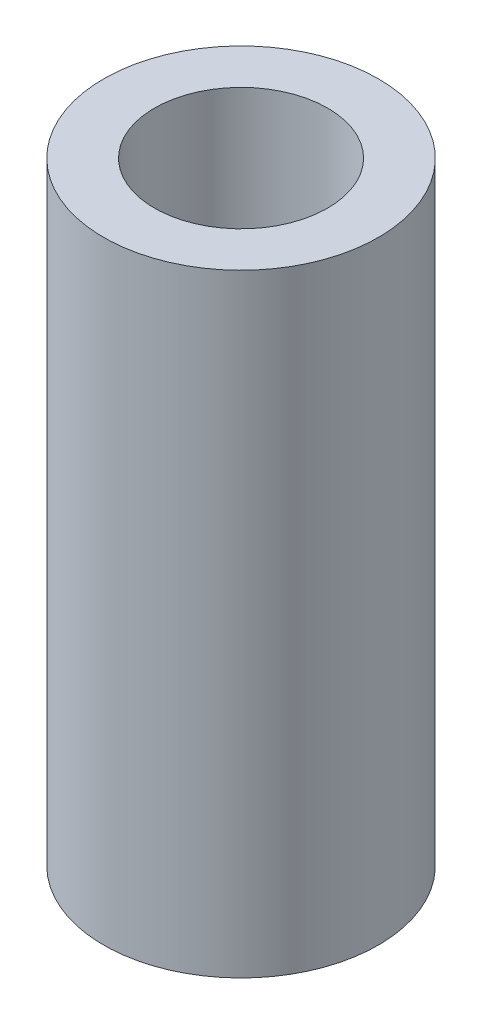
ISO-10303-21;
HEADER;
FILE_DESCRIPTION(('STEP AP214'),'2;1');
FILE_NAME('part.step','',(''),(''),'','','');
FILE_SCHEMA(('AUTOMOTIVE_DESIGN { 1 0 10303 214 1 1 1 1 }'));
ENDSEC;
DATA;
#1=APPLICATION_CONTEXT('core data for automotive mechanical design processes');
#2=APPLICATION_PROTOCOL_DEFINITION('international standard','automotive_design',2000,#1);
#3=PRODUCT_CONTEXT('',#1,'mechanical');
#4=PRODUCT('Part','Part','',(#3));
#5=PRODUCT_RELATED_PRODUCT_CATEGORY('part','',(#4));
#6=PRODUCT_DEFINITION_FORMATION('','',#4);
#7=PRODUCT_DEFINITION_CONTEXT('part definition',#1,'design');
#8=PRODUCT_DEFINITION('design','',#6,#7);
#9=PRODUCT_DEFINITION_SHAPE('','',#8);
#10=(LENGTH_UNIT() NAMED_UNIT(*) SI_UNIT(.MILLI.,.METRE.));
#11=(NAMED_UNIT(*) PLANE_ANGLE_UNIT() SI_UNIT($,.RADIAN.));
#12=(NAMED_UNIT(*) SI_UNIT($,.STERADIAN.) SOLID_ANGLE_UNIT());
#13=UNCERTAINTY_MEASURE_WITH_UNIT(LENGTH_MEASURE(1.E-05),#10,'distance_accuracy_value','');
#14=(GEOMETRIC_REPRESENTATION_CONTEXT(3) GLOBAL_UNCERTAINTY_ASSIGNED_CONTEXT((#13)) GLOBAL_UNIT_ASSIGNED_CONTEXT((#10,
#11,#12)) REPRESENTATION_CONTEXT('',''));
#15=CARTESIAN_POINT('',(0.,0.,0.));
#16=DIRECTION('',(0.,0.,1.));
#17=DIRECTION('',(1.,0.,0.));
#18=AXIS2_PLACEMENT_3D('',#15,#16,#17);
#19=CARTESIAN_POINT('',(0.,29.,0.));
#20=DIRECTION('',(0.,1.,0.));
#21=DIRECTION('',(0.,0.,1.));
#22=AXIS2_PLACEMENT_3D('',#19,#20,#21);
#23=PLANE('',#22);
#24=CARTESIAN_POINT('',(0.,29.,0.));
#25=DIRECTION('',(0.,1.,0.));
#26=DIRECTION('',(0.,0.,1.));
#27=AXIS2_PLACEMENT_3D('',#24,#25,#26);
#28=CIRCLE('',#27,6.5);
#29=CARTESIAN_POINT('',(0.,29.,-6.5));
#30=VERTEX_POINT('',#29);
#31=EDGE_CURVE('E10',#30,#30,#28,.T.);
#32=ORIENTED_EDGE('',*,*,#31,.T.);
#33=EDGE_LOOP('',(#32));
#34=FACE_BOUND('',#33,.T.);
#35=CARTESIAN_POINT('',(0.,29.,0.));
#36=DIRECTION('',(0.,1.,0.));
#37=DIRECTION('',(0.,0.,1.));
#38=AXIS2_PLACEMENT_3D('',#35,#36,#37);
#39=CIRCLE('',#38,4.1);
#40=CARTESIAN_POINT('',(0.,29.,-4.1));
#41=VERTEX_POINT('',#40);
#42=EDGE_CURVE('E43',#41,#41,#39,.T.);
#43=ORIENTED_EDGE('',*,*,#42,.F.);
#44=EDGE_LOOP('',(#43));
#45=FACE_BOUND('',#44,.T.);
#46=ADVANCED_FACE('F32',(#34,#45),#23,.T.);
#47=CARTESIAN_POINT('',(0.,0.,0.));
#48=DIRECTION('',(0.,1.,0.));
#49=DIRECTION('',(0.,0.,1.));
#50=AXIS2_PLACEMENT_3D('',#47,#48,#49);
#51=PLANE('',#50);
#52=CARTESIAN_POINT('',(0.,0.,0.));
#53=DIRECTION('',(0.,1.,0.));
#54=DIRECTION('',(0.,0.,1.));
#55=AXIS2_PLACEMENT_3D('',#52,#53,#54);
#56=CIRCLE('',#55,6.5);
#57=CARTESIAN_POINT('',(0.,0.,-6.5));
#58=VERTEX_POINT('',#57);
#59=EDGE_CURVE('E39',#58,#58,#56,.T.);
#60=ORIENTED_EDGE('',*,*,#59,.F.);
#61=EDGE_LOOP('',(#60));
#62=FACE_BOUND('',#61,.T.);
#63=CARTESIAN_POINT('',(0.,0.,0.));
#64=DIRECTION('',(0.,1.,0.));
#65=DIRECTION('',(0.,0.,1.));
#66=AXIS2_PLACEMENT_3D('',#63,#64,#65);
#67=CIRCLE('',#66,4.1);
#68=CARTESIAN_POINT('',(0.,0.,-4.1));
#69=VERTEX_POINT('',#68);
#70=EDGE_CURVE('E47',#69,#69,#67,.T.);
#71=ORIENTED_EDGE('',*,*,#70,.T.);
#72=EDGE_LOOP('',(#71));
#73=FACE_BOUND('',#72,.T.);
#74=ADVANCED_FACE('F53',(#62,#73),#51,.F.);
#75=CARTESIAN_POINT('',(0.,29.,0.));
#76=DIRECTION('',(0.,-1.,0.));
#77=DIRECTION('',(0.,0.,-1.));
#78=AXIS2_PLACEMENT_3D('',#75,#76,#77);
#79=CYLINDRICAL_SURFACE('',#78,6.5);
#80=CARTESIAN_POINT('',(0.,29.,-6.5));
#81=CARTESIAN_POINT('',(0.,28.6979166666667,-6.5));
#82=CARTESIAN_POINT('',(0.,28.3958333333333,-6.5));
#83=CARTESIAN_POINT('',(0.,27.7916666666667,-6.5));
#84=CARTESIAN_POINT('',(0.,27.4895833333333,-6.5));
#85=CARTESIAN_POINT('',(0.,26.8854166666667,-6.5));
#86=CARTESIAN_POINT('',(0.,26.5833333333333,-6.5));
#87=CARTESIAN_POINT('',(0.,25.9791666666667,-6.5));
#88=CARTESIAN_POINT('',(0.,25.6770833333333,-6.5));
#89=CARTESIAN_POINT('',(0.,25.0729166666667,-6.5));
#90=CARTESIAN_POINT('',(0.,24.7708333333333,-6.5));
#91=CARTESIAN_POINT('',(0.,24.1666666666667,-6.5));
#92=CARTESIAN_POINT('',(0.,23.8645833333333,-6.5));
#93=CARTESIAN_POINT('',(0.,23.2604166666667,-6.5));
#94=CARTESIAN_POINT('',(0.,22.9583333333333,-6.5));
#95=CARTESIAN_POINT('',(0.,22.3541666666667,-6.5));
#96=CARTESIAN_POINT('',(0.,22.0520833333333,-6.5));
#97=CARTESIAN_POINT('',(0.,21.4479166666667,-6.5));
#98=CARTESIAN_POINT('',(0.,21.1458333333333,-6.5));
#99=CARTESIAN_POINT('',(0.,20.5416666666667,-6.5));
#100=CARTESIAN_POINT('',(0.,20.2395833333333,-6.5));
#101=CARTESIAN_POINT('',(0.,19.6354166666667,-6.5));
#102=CARTESIAN_POINT('',(0.,19.3333333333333,-6.5));
#103=CARTESIAN_POINT('',(0.,18.7291666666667,-6.5));
#104=CARTESIAN_POINT('',(0.,18.4270833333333,-6.5));
#105=CARTESIAN_POINT('',(0.,17.8229166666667,-6.5));
#106=CARTESIAN_POINT('',(0.,17.5208333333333,-6.5));
#107=CARTESIAN_POINT('',(0.,16.9166666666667,-6.5));
#108=CARTESIAN_POINT('',(0.,16.6145833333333,-6.5));
#109=CARTESIAN_POINT('',(0.,16.0104166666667,-6.5));
#110=CARTESIAN_POINT('',(0.,15.7083333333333,-6.5));
#111=CARTESIAN_POINT('',(0.,15.1041666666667,-6.5));
#112=CARTESIAN_POINT('',(0.,14.8020833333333,-6.5));
#113=CARTESIAN_POINT('',(0.,14.1979166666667,-6.5));
#114=CARTESIAN_POINT('',(0.,13.8958333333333,-6.5));
#115=CARTESIAN_POINT('',(0.,13.2916666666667,-6.5));
#116=CARTESIAN_POINT('',(0.,12.9895833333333,-6.5));
#117=CARTESIAN_POINT('',(0.,12.3854166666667,-6.5));
#118=CARTESIAN_POINT('',(0.,12.0833333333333,-6.5));
#119=CARTESIAN_POINT('',(0.,11.4791666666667,-6.5));
#120=CARTESIAN_POINT('',(0.,11.1770833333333,-6.5));
#121=CARTESIAN_POINT('',(0.,10.5729166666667,-6.5));
#122=CARTESIAN_POINT('',(0.,10.2708333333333,-6.5));
#123=CARTESIAN_POINT('',(0.,9.66666666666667,-6.5));
#124=CARTESIAN_POINT('',(0.,9.36458333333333,-6.5));
#125=CARTESIAN_POINT('',(0.,8.76041666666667,-6.5));
#126=CARTESIAN_POINT('',(0.,8.45833333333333,-6.5));
#127=CARTESIAN_POINT('',(0.,7.85416666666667,-6.5));
#128=CARTESIAN_POINT('',(0.,7.55208333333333,-6.5));
#129=CARTESIAN_POINT('',(0.,6.94791666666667,-6.5));
#130=CARTESIAN_POINT('',(0.,6.64583333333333,-6.5));
#131=CARTESIAN_POINT('',(0.,6.04166666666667,-6.5));
#132=CARTESIAN_POINT('',(0.,5.73958333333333,-6.5));
#133=CARTESIAN_POINT('',(0.,5.13541666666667,-6.5));
#134=CARTESIAN_POINT('',(0.,4.83333333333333,-6.5));
#135=CARTESIAN_POINT('',(0.,4.22916666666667,-6.5));
#136=CARTESIAN_POINT('',(0.,3.92708333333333,-6.5));
#137=CARTESIAN_POINT('',(0.,3.32291666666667,-6.5));
#138=CARTESIAN_POINT('',(0.,3.02083333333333,-6.5));
#139=CARTESIAN_POINT('',(0.,2.41666666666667,-6.5));
#140=CARTESIAN_POINT('',(0.,2.11458333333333,-6.5));
#141=CARTESIAN_POINT('',(0.,1.51041666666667,-6.5));
#142=CARTESIAN_POINT('',(0.,1.20833333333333,-6.5));
#143=CARTESIAN_POINT('',(0.,0.604166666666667,-6.5));
#144=CARTESIAN_POINT('',(0.,0.302083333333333,-6.5));
#145=CARTESIAN_POINT('',(0.,0.,-6.5));
#146=B_SPLINE_CURVE_WITH_KNOTS('',3,(#80,#81,#82,#83,#84,#85,#86,#87,#88,#89,#90,#91,#92,#93,
#94,#95,#96,#97,#98,#99,#100,#101,#102,#103,#104,#105,#106,#107,#108,#109,#110,#111,#112,#113,
#114,#115,#116,#117,#118,#119,#120,#121,#122,#123,#124,#125,#126,#127,#128,#129,#130,#131,#132,
#133,#134,#135,#136,#137,#138,#139,#140,#141,#142,#143,#144,#145),.UNSPECIFIED.,.F.,.F.,(4,2,2,
2,2,2,2,2,2,2,2,2,2,2,2,2,2,2,2,2,2,2,2,2,2,2,2,2,2,2,2,2,4),(0.,0.906250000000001,1.8125,
2.71875,3.625,4.53125,5.4375,6.34375,7.25,8.15625,9.0625,9.96875,10.875,11.78125,12.6875,
13.59375,14.5,15.40625,16.3125,17.21875,18.125,19.03125,19.9375,20.84375,21.75,22.65625,23.5625,
24.46875,25.375,26.28125,27.1875,28.09375,29.),.UNSPECIFIED.);
#147=EDGE_CURVE('BSEAM34',#30,#58,#146,.T.);
#148=ORIENTED_EDGE('',*,*,#31,.F.);
#149=ORIENTED_EDGE('',*,*,#59,.T.);
#150=ORIENTED_EDGE('',*,*,#147,.T.);
#151=ORIENTED_EDGE('',*,*,#147,.F.);
#152=EDGE_LOOP('',(#148,#150,#149,#151));
#153=FACE_BOUND('',#152,.T.);
#154=ADVANCED_FACE('F34',(#153),#79,.T.);
#155=CARTESIAN_POINT('',(0.,29.,0.));
#156=DIRECTION('',(0.,-1.,0.));
#157=DIRECTION('',(0.,0.,-1.));
#158=AXIS2_PLACEMENT_3D('',#155,#156,#157);
#159=CYLINDRICAL_SURFACE('',#158,4.1);
#160=CARTESIAN_POINT('',(0.,29.,-4.1));
#161=CARTESIAN_POINT('',(0.,28.6979166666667,-4.1));
#162=CARTESIAN_POINT('',(0.,28.3958333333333,-4.1));
#163=CARTESIAN_POINT('',(0.,27.7916666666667,-4.1));
#164=CARTESIAN_POINT('',(0.,27.4895833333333,-4.1));
#165=CARTESIAN_POINT('',(0.,26.8854166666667,-4.1));
#166=CARTESIAN_POINT('',(0.,26.5833333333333,-4.1));
#167=CARTESIAN_POINT('',(0.,25.9791666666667,-4.1));
#168=CARTESIAN_POINT('',(0.,25.6770833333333,-4.1));
#169=CARTESIAN_POINT('',(0.,25.0729166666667,-4.1));
#170=CARTESIAN_POINT('',(0.,24.7708333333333,-4.1));
#171=CARTESIAN_POINT('',(0.,24.1666666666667,-4.1));
#172=CARTESIAN_POINT('',(0.,23.8645833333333,-4.1));
#173=CARTESIAN_POINT('',(0.,23.2604166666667,-4.1));
#174=CARTESIAN_POINT('',(0.,22.9583333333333,-4.1));
#175=CARTESIAN_POINT('',(0.,22.3541666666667,-4.1));
#176=CARTESIAN_POINT('',(0.,22.0520833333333,-4.1));
#177=CARTESIAN_POINT('',(0.,21.4479166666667,-4.1));
#178=CARTESIAN_POINT('',(0.,21.1458333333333,-4.1));
#179=CARTESIAN_POINT('',(0.,20.5416666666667,-4.1));
#180=CARTESIAN_POINT('',(0.,20.2395833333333,-4.1));
#181=CARTESIAN_POINT('',(0.,19.6354166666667,-4.1));
#182=CARTESIAN_POINT('',(0.,19.3333333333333,-4.1));
#183=CARTESIAN_POINT('',(0.,18.7291666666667,-4.1));
#184=CARTESIAN_POINT('',(0.,18.4270833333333,-4.1));
#185=CARTESIAN_POINT('',(0.,17.8229166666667,-4.1));
#186=CARTESIAN_POINT('',(0.,17.5208333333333,-4.1));
#187=CARTESIAN_POINT('',(0.,16.9166666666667,-4.1));
#188=CARTESIAN_POINT('',(0.,16.6145833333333,-4.1));
#189=CARTESIAN_POINT('',(0.,16.0104166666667,-4.1));
#190=CARTESIAN_POINT('',(0.,15.7083333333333,-4.1));
#191=CARTESIAN_POINT('',(0.,15.1041666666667,-4.1));
#192=CARTESIAN_POINT('',(0.,14.8020833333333,-4.1));
#193=CARTESIAN_POINT('',(0.,14.1979166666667,-4.1));
#194=CARTESIAN_POINT('',(0.,13.8958333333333,-4.1));
#195=CARTESIAN_POINT('',(0.,13.2916666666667,-4.1));
#196=CARTESIAN_POINT('',(0.,12.9895833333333,-4.1));
#197=CARTESIAN_POINT('',(0.,12.3854166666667,-4.1));
#198=CARTESIAN_POINT('',(0.,12.0833333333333,-4.1));
#199=CARTESIAN_POINT('',(0.,11.4791666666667,-4.1));
#200=CARTESIAN_POINT('',(0.,11.1770833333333,-4.1));
#201=CARTESIAN_POINT('',(0.,10.5729166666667,-4.1));
#202=CARTESIAN_POINT('',(0.,10.2708333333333,-4.1));
#203=CARTESIAN_POINT('',(0.,9.66666666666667,-4.1));
#204=CARTESIAN_POINT('',(0.,9.36458333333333,-4.1));
#205=CARTESIAN_POINT('',(0.,8.76041666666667,-4.1));
#206=CARTESIAN_POINT('',(0.,8.45833333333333,-4.1));
#207=CARTESIAN_POINT('',(0.,7.85416666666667,-4.1));
#208=CARTESIAN_POINT('',(0.,7.55208333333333,-4.1));
#209=CARTESIAN_POINT('',(0.,6.94791666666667,-4.1));
#210=CARTESIAN_POINT('',(0.,6.64583333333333,-4.1));
#211=CARTESIAN_POINT('',(0.,6.04166666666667,-4.1));
#212=CARTESIAN_POINT('',(0.,5.73958333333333,-4.1));
#213=CARTESIAN_POINT('',(0.,5.13541666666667,-4.1));
#214=CARTESIAN_POINT('',(0.,4.83333333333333,-4.1));
#215=CARTESIAN_POINT('',(0.,4.22916666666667,-4.1));
#216=CARTESIAN_POINT('',(0.,3.92708333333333,-4.1));
#217=CARTESIAN_POINT('',(0.,3.32291666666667,-4.1));
#218=CARTESIAN_POINT('',(0.,3.02083333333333,-4.1));
#219=CARTESIAN_POINT('',(0.,2.41666666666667,-4.1));
#220=CARTESIAN_POINT('',(0.,2.11458333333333,-4.1));
#221=CARTESIAN_POINT('',(0.,1.51041666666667,-4.1));
#222=CARTESIAN_POINT('',(0.,1.20833333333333,-4.1));
#223=CARTESIAN_POINT('',(0.,0.604166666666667,-4.1));
#224=CARTESIAN_POINT('',(0.,0.302083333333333,-4.1));
#225=CARTESIAN_POINT('',(0.,0.,-4.1));
#226=B_SPLINE_CURVE_WITH_KNOTS('',3,(#160,#161,#162,#163,#164,#165,#166,#167,#168,#169,#170,
#171,#172,#173,#174,#175,#176,#177,#178,#179,#180,#181,#182,#183,#184,#185,#186,#187,#188,#189,
#190,#191,#192,#193,#194,#195,#196,#197,#198,#199,#200,#201,#202,#203,#204,#205,#206,#207,#208,
#209,#210,#211,#212,#213,#214,#215,#216,#217,#218,#219,#220,#221,#222,#223,#224,#225),
.UNSPECIFIED.,.F.,.F.,(4,2,2,2,2,2,2,2,2,2,2,2,2,2,2,2,2,2,2,2,2,2,2,2,2,2,2,2,2,2,2,2,4),(0.,
0.906249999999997,1.8125,2.71875,3.625,4.53125,5.4375,6.34375,7.25,8.15625,9.0625,9.96875,
10.875,11.78125,12.6875,13.59375,14.5,15.40625,16.3125,17.21875,18.125,19.03125,19.9375,
20.84375,21.75,22.65625,23.5625,24.46875,25.375,26.28125,27.1875,28.09375,29.),.UNSPECIFIED.);
#227=EDGE_CURVE('BSEAM55',#41,#69,#226,.T.);
#228=ORIENTED_EDGE('',*,*,#42,.T.);
#229=ORIENTED_EDGE('',*,*,#70,.F.);
#230=ORIENTED_EDGE('',*,*,#227,.T.);
#231=ORIENTED_EDGE('',*,*,#227,.F.);
#232=EDGE_LOOP('',(#228,#230,#229,#231));
#233=FACE_BOUND('',#232,.T.);
#234=ADVANCED_FACE('F55',(#233),#159,.F.);
#235=CLOSED_SHELL('',(#46,#74,#154,#234));
#236=MANIFOLD_SOLID_BREP('B2',#235);
#237=ADVANCED_BREP_SHAPE_REPRESENTATION('',(#18,#236),#14);
#238=SHAPE_DEFINITION_REPRESENTATION(#9,#237);
ENDSEC;
END-ISO-10303-21;
